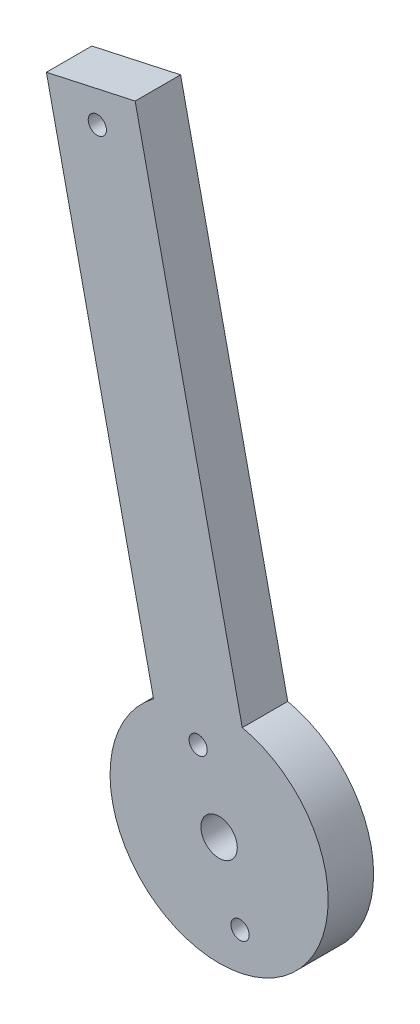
ISO-10303-21;
HEADER;
FILE_DESCRIPTION(('STEP AP214'),'2;1');
FILE_NAME('part.step','',(''),(''),'','','');
FILE_SCHEMA(('AUTOMOTIVE_DESIGN { 1 0 10303 214 1 1 1 1 }'));
ENDSEC;
DATA;
#1=APPLICATION_CONTEXT('core data for automotive mechanical design processes');
#2=APPLICATION_PROTOCOL_DEFINITION('international standard','automotive_design',2000,#1);
#3=PRODUCT_CONTEXT('',#1,'mechanical');
#4=PRODUCT('Part','Part','',(#3));
#5=PRODUCT_RELATED_PRODUCT_CATEGORY('part','',(#4));
#6=PRODUCT_DEFINITION_FORMATION('','',#4);
#7=PRODUCT_DEFINITION_CONTEXT('part definition',#1,'design');
#8=PRODUCT_DEFINITION('design','',#6,#7);
#9=PRODUCT_DEFINITION_SHAPE('','',#8);
#10=(LENGTH_UNIT() NAMED_UNIT(*) SI_UNIT(.MILLI.,.METRE.));
#11=(NAMED_UNIT(*) PLANE_ANGLE_UNIT() SI_UNIT($,.RADIAN.));
#12=(NAMED_UNIT(*) SI_UNIT($,.STERADIAN.) SOLID_ANGLE_UNIT());
#13=UNCERTAINTY_MEASURE_WITH_UNIT(LENGTH_MEASURE(1.E-05),#10,'distance_accuracy_value','');
#14=(GEOMETRIC_REPRESENTATION_CONTEXT(3) GLOBAL_UNCERTAINTY_ASSIGNED_CONTEXT((#13)) GLOBAL_UNIT_ASSIGNED_CONTEXT((#10,
#11,#12)) REPRESENTATION_CONTEXT('',''));
#15=CARTESIAN_POINT('',(0.,0.,0.));
#16=DIRECTION('',(0.,0.,1.));
#17=DIRECTION('',(1.,0.,0.));
#18=AXIS2_PLACEMENT_3D('',#15,#16,#17);
#19=CARTESIAN_POINT('',(0.,0.,5.));
#20=DIRECTION('',(0.,0.,-1.));
#21=DIRECTION('',(-1.,0.,0.));
#22=AXIS2_PLACEMENT_3D('',#19,#20,#21);
#23=CYLINDRICAL_SURFACE('',#22,12.);
#24=CARTESIAN_POINT('',(0.,0.,0.));
#25=DIRECTION('',(0.,0.,1.));
#26=DIRECTION('',(1.,0.,0.));
#27=AXIS2_PLACEMENT_3D('',#24,#25,#26);
#28=CIRCLE('',#27,12.);
#29=CARTESIAN_POINT('',(-7.21798584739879,9.58648425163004,0.));
#30=VERTEX_POINT('',#29);
#31=CARTESIAN_POINT('',(2.55049513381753,11.7258251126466,0.));
#32=VERTEX_POINT('',#31);
#33=EDGE_CURVE('E96',#30,#32,#28,.T.);
#34=ORIENTED_EDGE('',*,*,#33,.T.);
#35=DIRECTION('',(0.,0.,-1.));
#36=VECTOR('',#35,1.);
#37=CARTESIAN_POINT('',(2.55049513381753,11.7258251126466,5.));
#38=LINE('',#37,#36);
#39=CARTESIAN_POINT('',(2.55049513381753,11.7258251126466,5.));
#40=VERTEX_POINT('',#39);
#41=EDGE_CURVE('E11',#40,#32,#38,.T.);
#42=ORIENTED_EDGE('',*,*,#41,.F.);
#43=CARTESIAN_POINT('',(0.,0.,5.));
#44=DIRECTION('',(0.,0.,1.));
#45=DIRECTION('',(1.,0.,0.));
#46=AXIS2_PLACEMENT_3D('',#43,#44,#45);
#47=CIRCLE('',#46,12.);
#48=CARTESIAN_POINT('',(-7.21798584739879,9.58648425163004,5.));
#49=VERTEX_POINT('',#48);
#50=EDGE_CURVE('E84',#49,#40,#47,.T.);
#51=ORIENTED_EDGE('',*,*,#50,.F.);
#52=DIRECTION('',(0.,0.,-1.));
#53=VECTOR('',#52,1.);
#54=CARTESIAN_POINT('',(-7.21798584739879,9.58648425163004,5.));
#55=LINE('',#54,#53);
#56=EDGE_CURVE('E92',#49,#30,#55,.T.);
#57=ORIENTED_EDGE('',*,*,#56,.T.);
#58=EDGE_LOOP('',(#34,#42,#51,#57));
#59=FACE_BOUND('',#58,.T.);
#60=ADVANCED_FACE('F33',(#59),#23,.T.);
#61=CARTESIAN_POINT('',(-9.23540919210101,65.541644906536,5.));
#62=DIRECTION('',(-0.976848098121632,-0.213934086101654,0.));
#63=DIRECTION('',(0.213934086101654,-0.976848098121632,0.));
#64=AXIS2_PLACEMENT_3D('',#61,#62,#63);
#65=PLANE('',#64);
#66=DIRECTION('',(-0.213934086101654,0.976848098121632,0.));
#67=VECTOR('',#66,1.);
#68=CARTESIAN_POINT('',(-9.23540919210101,65.541644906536,0.));
#69=LINE('',#68,#67);
#70=CARTESIAN_POINT('',(-9.23540919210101,65.541644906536,0.));
#71=VERTEX_POINT('',#70);
#72=EDGE_CURVE('E88',#32,#71,#69,.T.);
#73=ORIENTED_EDGE('',*,*,#72,.T.);
#74=DIRECTION('',(0.,0.,-1.));
#75=VECTOR('',#74,1.);
#76=CARTESIAN_POINT('',(-9.23540919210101,65.541644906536,5.));
#77=LINE('',#76,#75);
#78=CARTESIAN_POINT('',(-9.23540919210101,65.541644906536,5.));
#79=VERTEX_POINT('',#78);
#80=EDGE_CURVE('E41',#79,#71,#77,.T.);
#81=ORIENTED_EDGE('',*,*,#80,.F.);
#82=DIRECTION('',(-0.213934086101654,0.976848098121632,0.));
#83=VECTOR('',#82,1.);
#84=CARTESIAN_POINT('',(-9.23540919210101,65.541644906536,5.));
#85=LINE('',#84,#83);
#86=EDGE_CURVE('E79',#40,#79,#85,.T.);
#87=ORIENTED_EDGE('',*,*,#86,.F.);
#88=ORIENTED_EDGE('',*,*,#41,.T.);
#89=EDGE_LOOP('',(#73,#81,#87,#88));
#90=FACE_BOUND('',#89,.T.);
#91=ADVANCED_FACE('F87',(#90),#65,.F.);
#92=CARTESIAN_POINT('',(-19.0038901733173,63.4023040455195,5.));
#93=DIRECTION('',(0.213934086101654,-0.976848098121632,0.));
#94=DIRECTION('',(0.976848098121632,0.213934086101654,0.));
#95=AXIS2_PLACEMENT_3D('',#92,#93,#94);
#96=PLANE('',#95);
#97=DIRECTION('',(-0.976848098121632,-0.213934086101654,0.));
#98=VECTOR('',#97,1.);
#99=CARTESIAN_POINT('',(-19.0038901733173,63.4023040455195,0.));
#100=LINE('',#99,#98);
#101=CARTESIAN_POINT('',(-19.0038901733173,63.4023040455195,0.));
#102=VERTEX_POINT('',#101);
#103=EDGE_CURVE('E66',#71,#102,#100,.T.);
#104=ORIENTED_EDGE('',*,*,#103,.T.);
#105=DIRECTION('',(0.,0.,-1.));
#106=VECTOR('',#105,1.);
#107=CARTESIAN_POINT('',(-19.0038901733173,63.4023040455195,5.));
#108=LINE('',#107,#106);
#109=CARTESIAN_POINT('',(-19.0038901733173,63.4023040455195,5.));
#110=VERTEX_POINT('',#109);
#111=EDGE_CURVE('E89',#110,#102,#108,.T.);
#112=ORIENTED_EDGE('',*,*,#111,.F.);
#113=DIRECTION('',(-0.976848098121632,-0.213934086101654,0.));
#114=VECTOR('',#113,1.);
#115=CARTESIAN_POINT('',(-19.0038901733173,63.4023040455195,5.));
#116=LINE('',#115,#114);
#117=EDGE_CURVE('E82',#79,#110,#116,.T.);
#118=ORIENTED_EDGE('',*,*,#117,.F.);
#119=ORIENTED_EDGE('',*,*,#80,.T.);
#120=EDGE_LOOP('',(#104,#112,#118,#119));
#121=FACE_BOUND('',#120,.T.);
#122=ADVANCED_FACE('F90',(#121),#96,.F.);
#123=CARTESIAN_POINT('',(-7.21798584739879,9.58648425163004,5.));
#124=DIRECTION('',(0.976848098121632,0.213934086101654,0.));
#125=DIRECTION('',(-0.213934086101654,0.976848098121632,0.));
#126=AXIS2_PLACEMENT_3D('',#123,#124,#125);
#127=PLANE('',#126);
#128=DIRECTION('',(0.213934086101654,-0.976848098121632,0.));
#129=VECTOR('',#128,1.);
#130=CARTESIAN_POINT('',(-7.21798584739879,9.58648425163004,0.));
#131=LINE('',#130,#129);
#132=EDGE_CURVE('E72',#102,#30,#131,.T.);
#133=ORIENTED_EDGE('',*,*,#132,.T.);
#134=ORIENTED_EDGE('',*,*,#56,.F.);
#135=DIRECTION('',(0.213934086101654,-0.976848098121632,0.));
#136=VECTOR('',#135,1.);
#137=CARTESIAN_POINT('',(-7.21798584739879,9.58648425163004,5.));
#138=LINE('',#137,#136);
#139=EDGE_CURVE('E49',#110,#49,#138,.T.);
#140=ORIENTED_EDGE('',*,*,#139,.F.);
#141=ORIENTED_EDGE('',*,*,#111,.T.);
#142=EDGE_LOOP('',(#133,#134,#140,#141));
#143=FACE_BOUND('',#142,.T.);
#144=ADVANCED_FACE('F104',(#143),#127,.F.);
#145=CARTESIAN_POINT('',(0.,0.,5.));
#146=DIRECTION('',(0.,0.,1.));
#147=DIRECTION('',(1.,0.,0.));
#148=AXIS2_PLACEMENT_3D('',#145,#146,#147);
#149=PLANE('',#148);
#150=CARTESIAN_POINT('',(2.30423308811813,-7.66097316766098,5.));
#151=DIRECTION('',(0.,0.,1.));
#152=DIRECTION('',(1.,0.,0.));
#153=AXIS2_PLACEMENT_3D('',#150,#151,#152);
#154=CIRCLE('',#153,1.);
#155=CARTESIAN_POINT('',(3.30423308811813,-7.66097316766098,5.));
#156=VERTEX_POINT('',#155);
#157=EDGE_CURVE('E128',#156,#156,#154,.T.);
#158=ORIENTED_EDGE('',*,*,#157,.F.);
#159=EDGE_LOOP('',(#158));
#160=FACE_BOUND('',#159,.T.);
#161=CARTESIAN_POINT('',(-2.30423308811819,7.66097316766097,5.));
#162=DIRECTION('',(0.,0.,1.));
#163=DIRECTION('',(1.,0.,0.));
#164=AXIS2_PLACEMENT_3D('',#161,#162,#163);
#165=CIRCLE('',#164,1.);
#166=CARTESIAN_POINT('',(-1.30423308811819,7.66097316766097,5.));
#167=VERTEX_POINT('',#166);
#168=EDGE_CURVE('E122',#167,#167,#165,.T.);
#169=ORIENTED_EDGE('',*,*,#168,.F.);
#170=EDGE_LOOP('',(#169));
#171=FACE_BOUND('',#170,.T.);
#172=CARTESIAN_POINT('',(-13.4006172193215,61.1887880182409,5.));
#173=DIRECTION('',(0.,0.,1.));
#174=DIRECTION('',(1.,0.,0.));
#175=AXIS2_PLACEMENT_3D('',#172,#173,#174);
#176=CIRCLE('',#175,1.);
#177=CARTESIAN_POINT('',(-12.4006172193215,61.1887880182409,5.));
#178=VERTEX_POINT('',#177);
#179=EDGE_CURVE('E116',#178,#178,#176,.T.);
#180=ORIENTED_EDGE('',*,*,#179,.F.);
#181=EDGE_LOOP('',(#180));
#182=FACE_BOUND('',#181,.T.);
#183=CARTESIAN_POINT('',(0.,0.,5.));
#184=DIRECTION('',(0.,0.,1.));
#185=DIRECTION('',(1.,0.,0.));
#186=AXIS2_PLACEMENT_3D('',#183,#184,#185);
#187=CIRCLE('',#186,2.);
#188=CARTESIAN_POINT('',(2.,0.,5.));
#189=VERTEX_POINT('',#188);
#190=EDGE_CURVE('E110',#189,#189,#187,.T.);
#191=ORIENTED_EDGE('',*,*,#190,.F.);
#192=EDGE_LOOP('',(#191));
#193=FACE_BOUND('',#192,.T.);
#194=ORIENTED_EDGE('',*,*,#50,.T.);
#195=ORIENTED_EDGE('',*,*,#86,.T.);
#196=ORIENTED_EDGE('',*,*,#117,.T.);
#197=ORIENTED_EDGE('',*,*,#139,.T.);
#198=EDGE_LOOP('',(#194,#195,#196,#197));
#199=FACE_BOUND('',#198,.T.);
#200=ADVANCED_FACE('F80',(#160,#171,#182,#193,#199),#149,.T.);
#201=CARTESIAN_POINT('',(0.,0.,0.));
#202=DIRECTION('',(0.,0.,1.));
#203=DIRECTION('',(1.,0.,0.));
#204=AXIS2_PLACEMENT_3D('',#201,#202,#203);
#205=PLANE('',#204);
#206=CARTESIAN_POINT('',(2.30423308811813,-7.66097316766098,0.));
#207=DIRECTION('',(0.,0.,1.));
#208=DIRECTION('',(1.,0.,0.));
#209=AXIS2_PLACEMENT_3D('',#206,#207,#208);
#210=CIRCLE('',#209,1.);
#211=CARTESIAN_POINT('',(3.30423308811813,-7.66097316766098,0.));
#212=VERTEX_POINT('',#211);
#213=EDGE_CURVE('E125',#212,#212,#210,.T.);
#214=ORIENTED_EDGE('',*,*,#213,.T.);
#215=EDGE_LOOP('',(#214));
#216=FACE_BOUND('',#215,.T.);
#217=CARTESIAN_POINT('',(-2.30423308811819,7.66097316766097,0.));
#218=DIRECTION('',(0.,0.,1.));
#219=DIRECTION('',(1.,0.,0.));
#220=AXIS2_PLACEMENT_3D('',#217,#218,#219);
#221=CIRCLE('',#220,1.);
#222=CARTESIAN_POINT('',(-1.30423308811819,7.66097316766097,0.));
#223=VERTEX_POINT('',#222);
#224=EDGE_CURVE('E119',#223,#223,#221,.T.);
#225=ORIENTED_EDGE('',*,*,#224,.T.);
#226=EDGE_LOOP('',(#225));
#227=FACE_BOUND('',#226,.T.);
#228=CARTESIAN_POINT('',(-13.4006172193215,61.1887880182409,0.));
#229=DIRECTION('',(0.,0.,1.));
#230=DIRECTION('',(1.,0.,0.));
#231=AXIS2_PLACEMENT_3D('',#228,#229,#230);
#232=CIRCLE('',#231,1.);
#233=CARTESIAN_POINT('',(-12.4006172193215,61.1887880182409,0.));
#234=VERTEX_POINT('',#233);
#235=EDGE_CURVE('E113',#234,#234,#232,.T.);
#236=ORIENTED_EDGE('',*,*,#235,.T.);
#237=EDGE_LOOP('',(#236));
#238=FACE_BOUND('',#237,.T.);
#239=CARTESIAN_POINT('',(0.,0.,0.));
#240=DIRECTION('',(0.,0.,1.));
#241=DIRECTION('',(1.,0.,0.));
#242=AXIS2_PLACEMENT_3D('',#239,#240,#241);
#243=CIRCLE('',#242,2.);
#244=CARTESIAN_POINT('',(2.,0.,0.));
#245=VERTEX_POINT('',#244);
#246=EDGE_CURVE('E99',#245,#245,#243,.T.);
#247=ORIENTED_EDGE('',*,*,#246,.T.);
#248=EDGE_LOOP('',(#247));
#249=FACE_BOUND('',#248,.T.);
#250=ORIENTED_EDGE('',*,*,#33,.F.);
#251=ORIENTED_EDGE('',*,*,#132,.F.);
#252=ORIENTED_EDGE('',*,*,#103,.F.);
#253=ORIENTED_EDGE('',*,*,#72,.F.);
#254=EDGE_LOOP('',(#250,#251,#252,#253));
#255=FACE_BOUND('',#254,.T.);
#256=ADVANCED_FACE('F107',(#216,#227,#238,#249,#255),#205,.F.);
#257=CARTESIAN_POINT('',(0.,0.,0.));
#258=DIRECTION('',(0.,0.,1.));
#259=DIRECTION('',(1.,0.,0.));
#260=AXIS2_PLACEMENT_3D('',#257,#258,#259);
#261=CYLINDRICAL_SURFACE('',#260,2.);
#262=ORIENTED_EDGE('',*,*,#246,.F.);
#263=EDGE_LOOP('',(#262));
#264=FACE_BOUND('',#263,.T.);
#265=ORIENTED_EDGE('',*,*,#190,.T.);
#266=EDGE_LOOP('',(#265));
#267=FACE_BOUND('',#266,.T.);
#268=ADVANCED_FACE('F152',(#264,#267),#261,.F.);
#269=CARTESIAN_POINT('',(-13.4006172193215,61.1887880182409,0.));
#270=DIRECTION('',(0.,0.,1.));
#271=DIRECTION('',(1.,0.,0.));
#272=AXIS2_PLACEMENT_3D('',#269,#270,#271);
#273=CYLINDRICAL_SURFACE('',#272,1.);
#274=ORIENTED_EDGE('',*,*,#235,.F.);
#275=EDGE_LOOP('',(#274));
#276=FACE_BOUND('',#275,.T.);
#277=ORIENTED_EDGE('',*,*,#179,.T.);
#278=EDGE_LOOP('',(#277));
#279=FACE_BOUND('',#278,.T.);
#280=ADVANCED_FACE('F154',(#276,#279),#273,.F.);
#281=CARTESIAN_POINT('',(-2.30423308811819,7.66097316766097,0.));
#282=DIRECTION('',(0.,0.,1.));
#283=DIRECTION('',(1.,0.,0.));
#284=AXIS2_PLACEMENT_3D('',#281,#282,#283);
#285=CYLINDRICAL_SURFACE('',#284,1.);
#286=ORIENTED_EDGE('',*,*,#224,.F.);
#287=EDGE_LOOP('',(#286));
#288=FACE_BOUND('',#287,.T.);
#289=ORIENTED_EDGE('',*,*,#168,.T.);
#290=EDGE_LOOP('',(#289));
#291=FACE_BOUND('',#290,.T.);
#292=ADVANCED_FACE('F139',(#288,#291),#285,.F.);
#293=CARTESIAN_POINT('',(2.30423308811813,-7.66097316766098,0.));
#294=DIRECTION('',(0.,0.,1.));
#295=DIRECTION('',(1.,0.,0.));
#296=AXIS2_PLACEMENT_3D('',#293,#294,#295);
#297=CYLINDRICAL_SURFACE('',#296,1.);
#298=ORIENTED_EDGE('',*,*,#213,.F.);
#299=EDGE_LOOP('',(#298));
#300=FACE_BOUND('',#299,.T.);
#301=ORIENTED_EDGE('',*,*,#157,.T.);
#302=EDGE_LOOP('',(#301));
#303=FACE_BOUND('',#302,.T.);
#304=ADVANCED_FACE('F136',(#300,#303),#297,.F.);
#305=CLOSED_SHELL('',(#60,#91,#122,#144,#200,#256,#268,#280,#292,#304));
#306=MANIFOLD_SOLID_BREP('B2',#305);
#307=ADVANCED_BREP_SHAPE_REPRESENTATION('',(#18,#306),#14);
#308=SHAPE_DEFINITION_REPRESENTATION(#9,#307);
ENDSEC;
END-ISO-10303-21;
